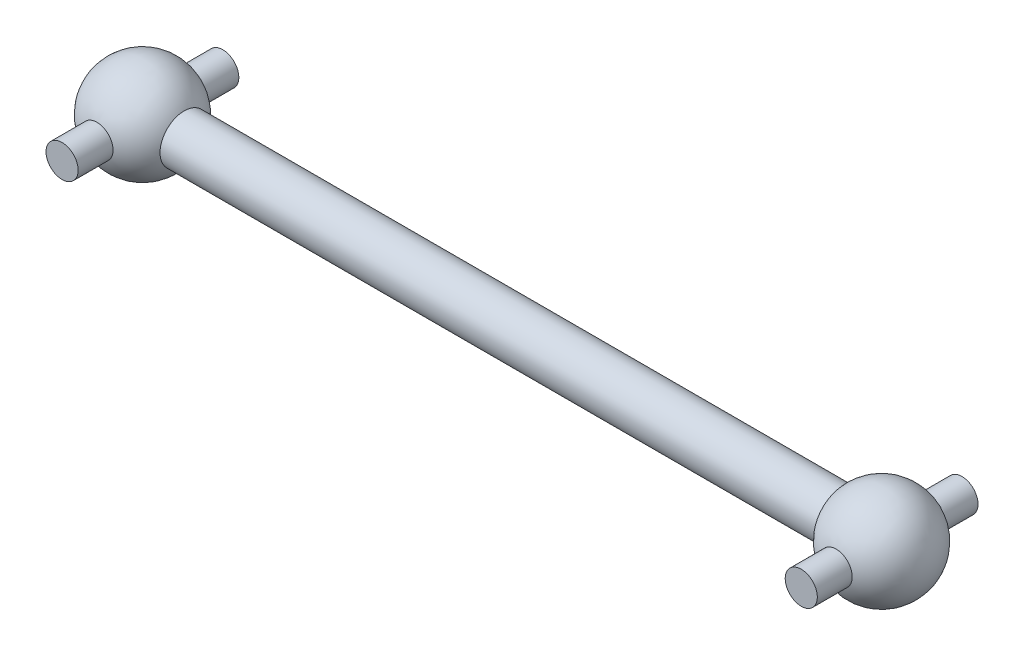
from build123d import *

# Parameters (mm, degrees)
ESQUISSE2_R        = 1
BOSS_EXTRU_1_DEPTH = 5


with BuildPart() as part:
    # Esquisse1 → Base-R_volution (revolve)
    with BuildSketch(Plane.XY):
        with BuildLine():
            Line((-20.401923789, 1.5), (20.401923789, 1.5))
            ThreePointArc((20.401923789, 1.5), (23.776457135, 2.897777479), (26, 0))
            Line((26, 0), (-26, 0))
            ThreePointArc((-26, 0), (-23.776457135, 2.897777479), (-20.401923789, 1.5))
        make_face()
    revolve(axis=Axis((-25.705096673, 0, 0), (1, 0, 0)))

    # Esquisse2 → Boss.-Extru.1 (add, symmetric)
    with BuildSketch(Plane.XY):
        with Locations(Location((-23, 0, 0), (0, 0, 180))):
            Circle(ESQUISSE2_R)
        with Locations(Location((23, 0, 0), (0, 0, 180))):
            Circle(ESQUISSE2_R)
    extrude(amount=BOSS_EXTRU_1_DEPTH, both=True)


solid = part.part
